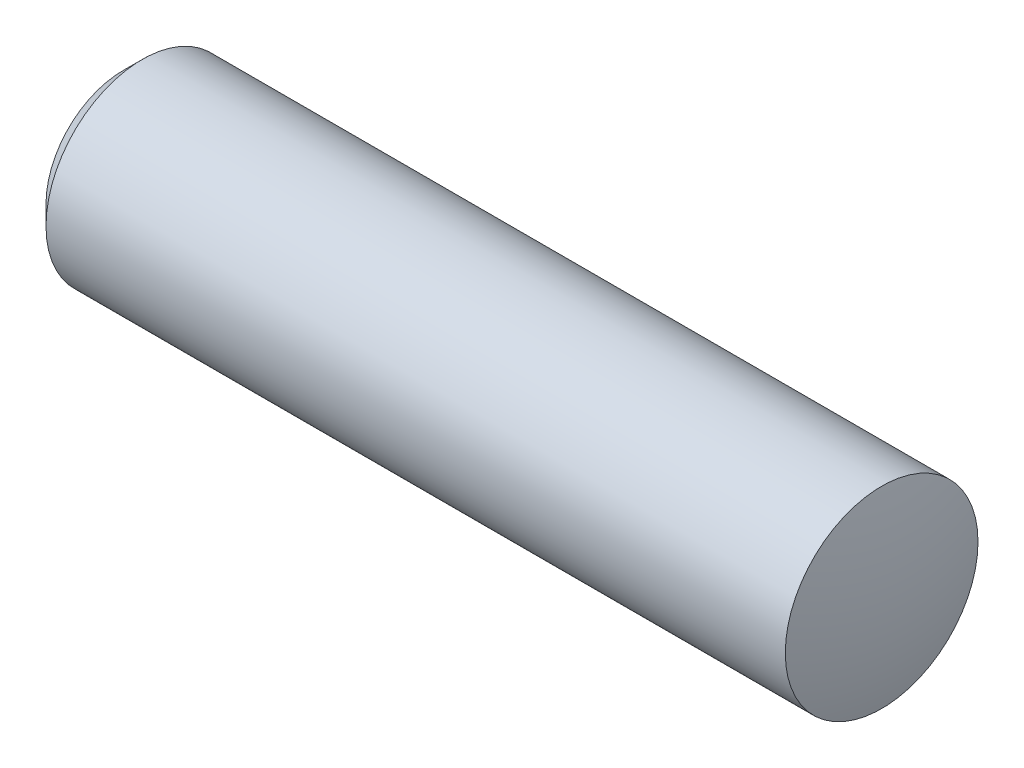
ISO-10303-21;
HEADER;
FILE_DESCRIPTION(('STEP AP214'),'2;1');
FILE_NAME('part.step','',(''),(''),'','','');
FILE_SCHEMA(('AUTOMOTIVE_DESIGN { 1 0 10303 214 1 1 1 1 }'));
ENDSEC;
DATA;
#1=APPLICATION_CONTEXT('core data for automotive mechanical design processes');
#2=APPLICATION_PROTOCOL_DEFINITION('international standard','automotive_design',2000,#1);
#3=PRODUCT_CONTEXT('',#1,'mechanical');
#4=PRODUCT('Part','Part','',(#3));
#5=PRODUCT_RELATED_PRODUCT_CATEGORY('part','',(#4));
#6=PRODUCT_DEFINITION_FORMATION('','',#4);
#7=PRODUCT_DEFINITION_CONTEXT('part definition',#1,'design');
#8=PRODUCT_DEFINITION('design','',#6,#7);
#9=PRODUCT_DEFINITION_SHAPE('','',#8);
#10=(LENGTH_UNIT() NAMED_UNIT(*) SI_UNIT(.MILLI.,.METRE.));
#11=(NAMED_UNIT(*) PLANE_ANGLE_UNIT() SI_UNIT($,.RADIAN.));
#12=(NAMED_UNIT(*) SI_UNIT($,.STERADIAN.) SOLID_ANGLE_UNIT());
#13=UNCERTAINTY_MEASURE_WITH_UNIT(LENGTH_MEASURE(1.E-05),#10,'distance_accuracy_value','');
#14=(GEOMETRIC_REPRESENTATION_CONTEXT(3) GLOBAL_UNCERTAINTY_ASSIGNED_CONTEXT((#13)) GLOBAL_UNIT_ASSIGNED_CONTEXT((#10,
#11,#12)) REPRESENTATION_CONTEXT('',''));
#15=CARTESIAN_POINT('',(0.,0.,0.));
#16=DIRECTION('',(0.,0.,1.));
#17=DIRECTION('',(1.,0.,0.));
#18=AXIS2_PLACEMENT_3D('',#15,#16,#17);
#19=CARTESIAN_POINT('',(-5.99999999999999,0.,0.));
#20=DIRECTION('',(-1.,0.,0.));
#21=DIRECTION('',(0.,0.,-1.));
#22=AXIS2_PLACEMENT_3D('',#19,#20,#21);
#23=SPHERICAL_SURFACE('',#22,5.99999999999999);
#24=CARTESIAN_POINT('',(-0.190524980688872,0.,0.));
#25=DIRECTION('',(-1.,0.,0.));
#26=DIRECTION('',(0.,0.,1.));
#27=AXIS2_PLACEMENT_3D('',#24,#25,#26);
#28=CIRCLE('',#27,1.49999999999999);
#29=CARTESIAN_POINT('',(-0.190524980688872,0.,1.49999999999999));
#30=VERTEX_POINT('',#29);
#31=EDGE_CURVE('E10',#30,#30,#28,.T.);
#32=ORIENTED_EDGE('',*,*,#31,.F.);
#33=EDGE_LOOP('',(#32));
#34=FACE_BOUND('',#33,.T.);
#35=ADVANCED_FACE('F32',(#34),#23,.T.);
#36=CARTESIAN_POINT('',(0.,0.,0.));
#37=DIRECTION('',(-1.,0.,0.));
#38=DIRECTION('',(0.,0.,1.));
#39=AXIS2_PLACEMENT_3D('',#36,#37,#38);
#40=CYLINDRICAL_SURFACE('',#39,1.49999999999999);
#41=CARTESIAN_POINT('',(-11.7,0.,0.));
#42=DIRECTION('',(-1.,0.,0.));
#43=DIRECTION('',(0.,0.,1.));
#44=AXIS2_PLACEMENT_3D('',#41,#42,#43);
#45=CIRCLE('',#44,1.49999999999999);
#46=CARTESIAN_POINT('',(-11.7,0.,1.49999999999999));
#47=VERTEX_POINT('',#46);
#48=EDGE_CURVE('E38',#47,#47,#45,.T.);
#49=ORIENTED_EDGE('',*,*,#48,.F.);
#50=EDGE_LOOP('',(#49));
#51=FACE_BOUND('',#50,.T.);
#52=ORIENTED_EDGE('',*,*,#31,.T.);
#53=EDGE_LOOP('',(#52));
#54=FACE_BOUND('',#53,.T.);
#55=ADVANCED_FACE('F53',(#51,#54),#40,.T.);
#56=CARTESIAN_POINT('',(-11.7,0.,0.));
#57=DIRECTION('',(1.,0.,0.));
#58=DIRECTION('',(0.,0.,-1.));
#59=AXIS2_PLACEMENT_3D('',#56,#57,#58);
#60=CONICAL_SURFACE('',#59,1.49999999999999,0.785398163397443);
#61=CARTESIAN_POINT('',(-12.,0.,0.));
#62=DIRECTION('',(-1.,0.,0.));
#63=DIRECTION('',(0.,0.,1.));
#64=AXIS2_PLACEMENT_3D('',#61,#62,#63);
#65=CIRCLE('',#64,1.19999999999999);
#66=CARTESIAN_POINT('',(-12.,0.,1.19999999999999));
#67=VERTEX_POINT('',#66);
#68=EDGE_CURVE('E42',#67,#67,#65,.T.);
#69=ORIENTED_EDGE('',*,*,#68,.F.);
#70=EDGE_LOOP('',(#69));
#71=FACE_BOUND('',#70,.T.);
#72=ORIENTED_EDGE('',*,*,#48,.T.);
#73=EDGE_LOOP('',(#72));
#74=FACE_BOUND('',#73,.T.);
#75=ADVANCED_FACE('F51',(#71,#74),#60,.T.);
#76=CARTESIAN_POINT('',(-12.,0.,0.));
#77=DIRECTION('',(1.,0.,0.));
#78=DIRECTION('',(0.,0.,-1.));
#79=AXIS2_PLACEMENT_3D('',#76,#77,#78);
#80=PLANE('',#79);
#81=ORIENTED_EDGE('',*,*,#68,.T.);
#82=EDGE_LOOP('',(#81));
#83=FACE_BOUND('',#82,.T.);
#84=ADVANCED_FACE('F49',(#83),#80,.F.);
#85=CLOSED_SHELL('',(#35,#55,#75,#84));
#86=MANIFOLD_SOLID_BREP('B2',#85);
#87=ADVANCED_BREP_SHAPE_REPRESENTATION('',(#18,#86),#14);
#88=SHAPE_DEFINITION_REPRESENTATION(#9,#87);
ENDSEC;
END-ISO-10303-21;
